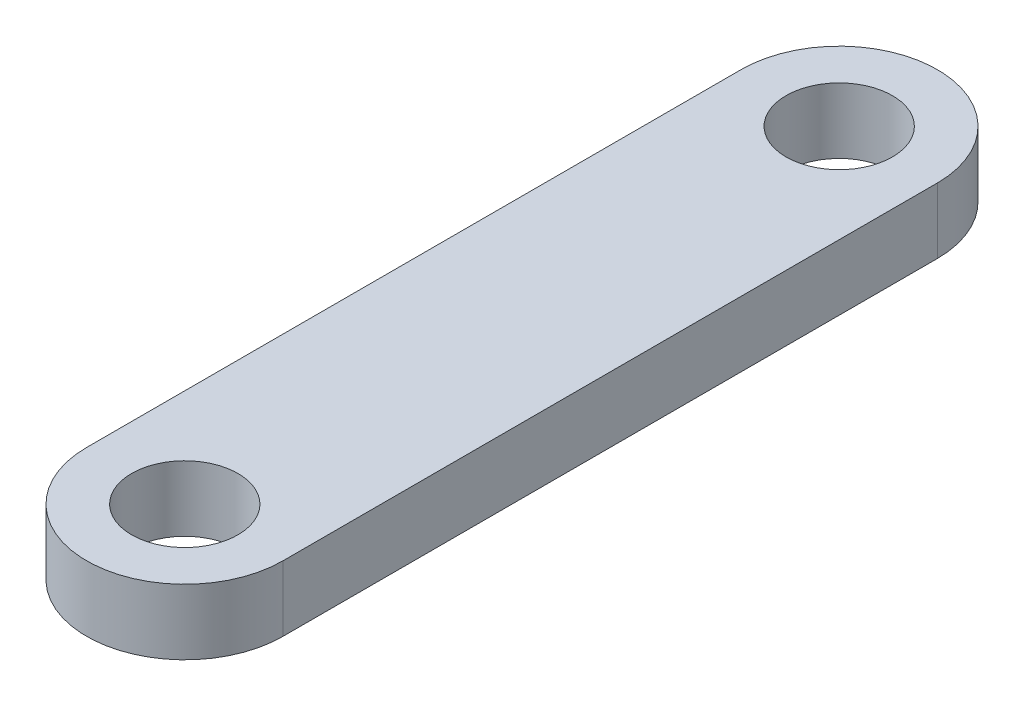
from build123d import *

# Parameters (mm, degrees)
SKETCH1_R      = 3.25
EXTRUDE1_DEPTH = 4


with BuildPart() as part:
    # Sketch1 → Extrude1 (new body)
    with BuildSketch(Plane(origin=(0, 0, 0), x_dir=(1, 0, 0), z_dir=(0, 1, 0))):
        with BuildLine():
            Line((6, 40), (6, 0))
            ThreePointArc((6, 0), (0, -6), (-6, 0))
            Line((-6, 0), (-6, 40))
            ThreePointArc((-6, 40), (0, 46), (6, 40))
        make_face()
        with Locations(Location((0, 40, 0), (0, 0, 270))):
            Circle(SKETCH1_R, mode=Mode.SUBTRACT)
        with Locations(Location((0, 0, 0), (0, 0, 270))):
            Circle(SKETCH1_R, mode=Mode.SUBTRACT)
    extrude(amount=EXTRUDE1_DEPTH)


solid = part.part
